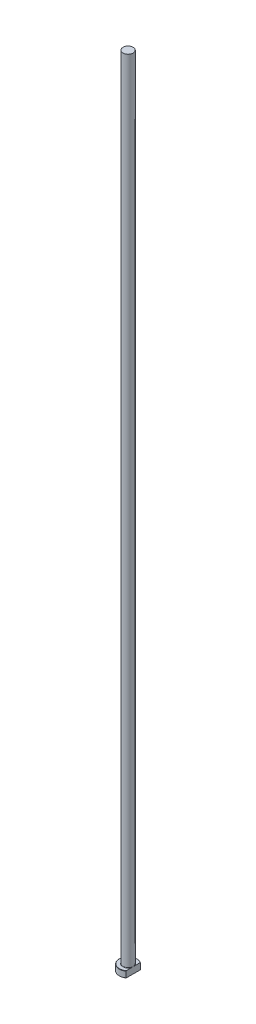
from build123d import *
from build123d.topology import SkipClean

# Parameters (mm, degrees)
CHAMFER1_SIZE = 0.2
FILLET1_R     = 0.2
KEY_DEPTH     = 631.077772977


with BuildPart() as part:
    # Sketch1 → Revolve1 (revolve)
    with BuildSketch(Plane.XY, mode=Mode.PRIVATE) as revolve1_sk:
        Polygon((0, 0), (-7, 0), (-7, 5), (-4, 5), (-4, 630), (0, 630), align=None)
    revolve(revolve1_sk.sketch.rotate(Axis((0, 259.958771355, 0), (0, -1, 0)), 270), axis=Axis((0, 259.958771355, 0), (0, -1, 0)))

    # Chamfer1
    chamfer1_edges = [part.edges().sort_by_distance(p)[0] for p in [
        (0, 5, -7),
        (0, 0, -7),
    ]]
    chamfer(chamfer1_edges, length=CHAMFER1_SIZE)

    # Fillet1
    fillet1_edges = [part.edges().sort_by_distance(p)[0] for p in [
        (0, 5, -4),
    ]]
    fillet(fillet1_edges, radius=FILLET1_R)

    # Sketch2 → KEY (cut, through all)
    with SkipClean():  # the faces are left unmerged after this step: merging them gives an invalid solid
        with BuildSketch(Plane(origin=(0, 0, 0), x_dir=(1, 0, 0), z_dir=(0, 1, 0))):
            with BuildLine():
                Line((4, 5.744562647), (4, -5.744562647))
                ThreePointArc((4, -5.744562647), (7, 0), (4, 5.744562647))
            make_face()
        extrude(amount=KEY_DEPTH, mode=Mode.SUBTRACT)


solid = part.part
